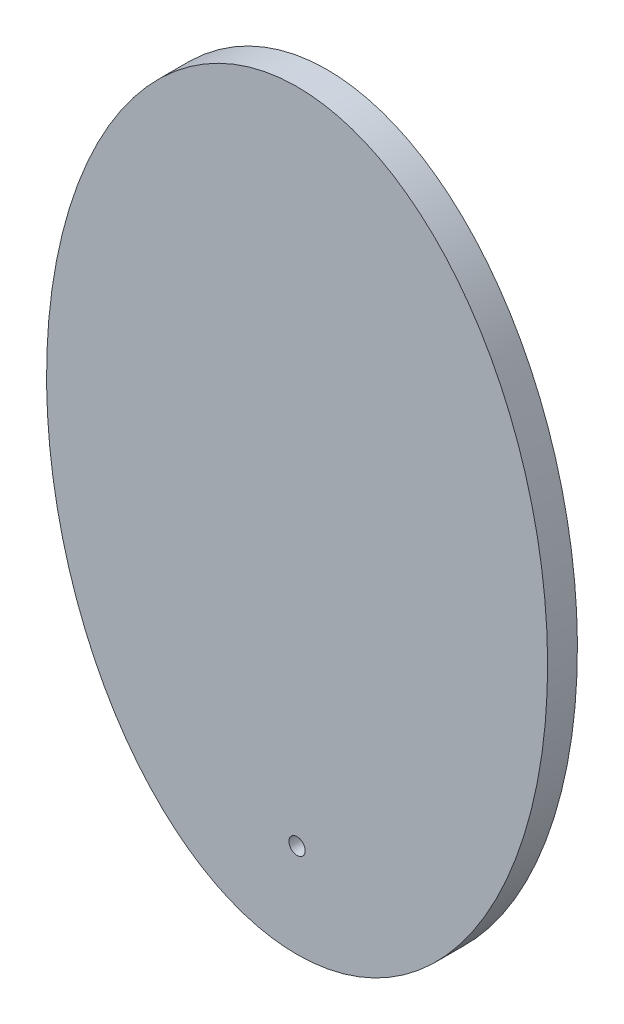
ISO-10303-21;
HEADER;
FILE_DESCRIPTION(('STEP AP214'),'2;1');
FILE_NAME('part.step','',(''),(''),'','','');
FILE_SCHEMA(('AUTOMOTIVE_DESIGN { 1 0 10303 214 1 1 1 1 }'));
ENDSEC;
DATA;
#1=APPLICATION_CONTEXT('core data for automotive mechanical design processes');
#2=APPLICATION_PROTOCOL_DEFINITION('international standard','automotive_design',2000,#1);
#3=PRODUCT_CONTEXT('',#1,'mechanical');
#4=PRODUCT('Part','Part','',(#3));
#5=PRODUCT_RELATED_PRODUCT_CATEGORY('part','',(#4));
#6=PRODUCT_DEFINITION_FORMATION('','',#4);
#7=PRODUCT_DEFINITION_CONTEXT('part definition',#1,'design');
#8=PRODUCT_DEFINITION('design','',#6,#7);
#9=PRODUCT_DEFINITION_SHAPE('','',#8);
#10=(LENGTH_UNIT() NAMED_UNIT(*) SI_UNIT(.MILLI.,.METRE.));
#11=(NAMED_UNIT(*) PLANE_ANGLE_UNIT() SI_UNIT($,.RADIAN.));
#12=(NAMED_UNIT(*) SI_UNIT($,.STERADIAN.) SOLID_ANGLE_UNIT());
#13=UNCERTAINTY_MEASURE_WITH_UNIT(LENGTH_MEASURE(1.E-05),#10,'distance_accuracy_value','');
#14=(GEOMETRIC_REPRESENTATION_CONTEXT(3) GLOBAL_UNCERTAINTY_ASSIGNED_CONTEXT((#13)) GLOBAL_UNIT_ASSIGNED_CONTEXT((#10,
#11,#12)) REPRESENTATION_CONTEXT('',''));
#15=CARTESIAN_POINT('',(0.,0.,0.));
#16=DIRECTION('',(0.,0.,1.));
#17=DIRECTION('',(1.,0.,0.));
#18=AXIS2_PLACEMENT_3D('',#15,#16,#17);
#19=CARTESIAN_POINT('',(0.,0.,-4.7625));
#20=DIRECTION('',(0.,0.,1.));
#21=DIRECTION('',(0.,-1.,0.));
#22=AXIS2_PLACEMENT_3D('',#19,#20,#21);
#23=ELLIPSE('',#22,60.,40.);
#24=DIRECTION('',(0.,0.,1.));
#25=VECTOR('',#24,1.);
#26=SURFACE_OF_LINEAR_EXTRUSION('',#23,#25);
#27=CARTESIAN_POINT('',(0.,-60.,-4.7625));
#28=VERTEX_POINT('',#27);
#29=EDGE_CURVE('E10',#28,#28,#23,.T.);
#30=ORIENTED_EDGE('',*,*,#29,.T.);
#31=EDGE_LOOP('',(#30));
#32=FACE_BOUND('',#31,.T.);
#33=CARTESIAN_POINT('',(0.,0.,0.));
#34=DIRECTION('',(0.,0.,1.));
#35=DIRECTION('',(0.,-1.,0.));
#36=AXIS2_PLACEMENT_3D('',#33,#34,#35);
#37=ELLIPSE('',#36,60.,40.);
#38=CARTESIAN_POINT('',(0.,-60.,0.));
#39=VERTEX_POINT('',#38);
#40=EDGE_CURVE('E40',#39,#39,#37,.T.);
#41=ORIENTED_EDGE('',*,*,#40,.F.);
#42=EDGE_LOOP('',(#41));
#43=FACE_BOUND('',#42,.T.);
#44=ADVANCED_FACE('F32',(#32,#43),#26,.T.);
#45=CARTESIAN_POINT('',(0.,0.,-4.7625));
#46=DIRECTION('',(0.,0.,1.));
#47=DIRECTION('',(1.,0.,0.));
#48=AXIS2_PLACEMENT_3D('',#45,#46,#47);
#49=PLANE('',#48);
#50=CARTESIAN_POINT('',(0.,-45.,-4.7625));
#51=DIRECTION('',(0.,0.,-1.));
#52=DIRECTION('',(0.,1.,0.));
#53=AXIS2_PLACEMENT_3D('',#50,#51,#52);
#54=CIRCLE('',#53,1.3);
#55=CARTESIAN_POINT('',(0.,-43.7,-4.7625));
#56=VERTEX_POINT('',#55);
#57=EDGE_CURVE('E98',#56,#56,#54,.T.);
#58=ORIENTED_EDGE('',*,*,#57,.F.);
#59=EDGE_LOOP('',(#58));
#60=FACE_BOUND('',#59,.T.);
#61=CARTESIAN_POINT('',(31.9550357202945,-30.,-4.7625));
#62=DIRECTION('',(0.,0.,-1.));
#63=DIRECTION('',(0.,1.,0.));
#64=AXIS2_PLACEMENT_3D('',#61,#62,#63);
#65=CIRCLE('',#64,2.25);
#66=CARTESIAN_POINT('',(31.9550357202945,-27.75,-4.7625));
#67=VERTEX_POINT('',#66);
#68=EDGE_CURVE('E80',#67,#67,#65,.T.);
#69=ORIENTED_EDGE('',*,*,#68,.F.);
#70=EDGE_LOOP('',(#69));
#71=FACE_BOUND('',#70,.T.);
#72=CARTESIAN_POINT('',(-31.9549994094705,-30.,-4.7625));
#73=DIRECTION('',(0.,0.,-1.));
#74=DIRECTION('',(0.,1.,0.));
#75=AXIS2_PLACEMENT_3D('',#72,#73,#74);
#76=CIRCLE('',#75,2.25);
#77=CARTESIAN_POINT('',(-31.9549994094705,-27.75,-4.7625));
#78=VERTEX_POINT('',#77);
#79=EDGE_CURVE('E87',#78,#78,#76,.T.);
#80=ORIENTED_EDGE('',*,*,#79,.F.);
#81=EDGE_LOOP('',(#80));
#82=FACE_BOUND('',#81,.T.);
#83=CARTESIAN_POINT('',(-26.879913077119,40.,-4.7625));
#84=DIRECTION('',(0.,0.,-1.));
#85=DIRECTION('',(0.,1.,0.));
#86=AXIS2_PLACEMENT_3D('',#83,#84,#85);
#87=CIRCLE('',#86,2.25);
#88=CARTESIAN_POINT('',(-26.879913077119,42.25,-4.7625));
#89=VERTEX_POINT('',#88);
#90=EDGE_CURVE('E93',#89,#89,#87,.T.);
#91=ORIENTED_EDGE('',*,*,#90,.F.);
#92=EDGE_LOOP('',(#91));
#93=FACE_BOUND('',#92,.T.);
#94=CARTESIAN_POINT('',(26.8808899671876,40.,-4.7625));
#95=DIRECTION('',(0.,0.,-1.));
#96=DIRECTION('',(0.,1.,0.));
#97=AXIS2_PLACEMENT_3D('',#94,#95,#96);
#98=CIRCLE('',#97,2.25);
#99=CARTESIAN_POINT('',(26.8808899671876,42.25,-4.7625));
#100=VERTEX_POINT('',#99);
#101=EDGE_CURVE('E74',#100,#100,#98,.T.);
#102=ORIENTED_EDGE('',*,*,#101,.F.);
#103=EDGE_LOOP('',(#102));
#104=FACE_BOUND('',#103,.T.);
#105=ORIENTED_EDGE('',*,*,#29,.F.);
#106=EDGE_LOOP('',(#105));
#107=FACE_BOUND('',#106,.T.);
#108=ADVANCED_FACE('F114',(#60,#71,#82,#93,#104,#107),#49,.F.);
#109=CARTESIAN_POINT('',(0.,0.,0.));
#110=DIRECTION('',(0.,0.,1.));
#111=DIRECTION('',(1.,0.,0.));
#112=AXIS2_PLACEMENT_3D('',#109,#110,#111);
#113=PLANE('',#112);
#114=CARTESIAN_POINT('',(0.,-45.,0.));
#115=DIRECTION('',(0.,0.,-1.));
#116=DIRECTION('',(0.,1.,0.));
#117=AXIS2_PLACEMENT_3D('',#114,#115,#116);
#118=CIRCLE('',#117,1.3);
#119=CARTESIAN_POINT('',(0.,-43.7,0.));
#120=VERTEX_POINT('',#119);
#121=EDGE_CURVE('E84',#120,#120,#118,.T.);
#122=ORIENTED_EDGE('',*,*,#121,.T.);
#123=EDGE_LOOP('',(#122));
#124=FACE_BOUND('',#123,.T.);
#125=ORIENTED_EDGE('',*,*,#40,.T.);
#126=EDGE_LOOP('',(#125));
#127=FACE_BOUND('',#126,.T.);
#128=ADVANCED_FACE('F104',(#124,#127),#113,.T.);
#129=CARTESIAN_POINT('',(31.9550357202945,-30.,-4.2625));
#130=DIRECTION('',(0.,0.,-1.));
#131=DIRECTION('',(0.,1.,0.));
#132=AXIS2_PLACEMENT_3D('',#129,#130,#131);
#133=PLANE('',#132);
#134=CARTESIAN_POINT('',(31.9550357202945,-30.,-4.2625));
#135=DIRECTION('',(0.,0.,-1.));
#136=DIRECTION('',(0.,1.,0.));
#137=AXIS2_PLACEMENT_3D('',#134,#135,#136);
#138=CIRCLE('',#137,2.25);
#139=CARTESIAN_POINT('',(31.9550357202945,-27.75,-4.2625));
#140=VERTEX_POINT('',#139);
#141=EDGE_CURVE('E83',#140,#140,#138,.T.);
#142=ORIENTED_EDGE('',*,*,#141,.T.);
#143=EDGE_LOOP('',(#142));
#144=FACE_BOUND('',#143,.T.);
#145=CARTESIAN_POINT('',(31.9550357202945,-30.,-4.2625));
#146=DIRECTION('',(0.,0.,-1.));
#147=DIRECTION('',(0.,1.,0.));
#148=AXIS2_PLACEMENT_3D('',#145,#146,#147);
#149=CIRCLE('',#148,1.65);
#150=CARTESIAN_POINT('',(31.9550357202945,-28.35,-4.2625));
#151=VERTEX_POINT('',#150);
#152=EDGE_CURVE('E50',#151,#151,#149,.F.);
#153=ORIENTED_EDGE('',*,*,#152,.T.);
#154=EDGE_LOOP('',(#153));
#155=FACE_BOUND('',#154,.T.);
#156=ADVANCED_FACE('F150',(#144,#155),#133,.T.);
#157=CARTESIAN_POINT('',(31.9550357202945,-30.,-4.2625));
#158=DIRECTION('',(0.,0.,-1.));
#159=DIRECTION('',(0.,1.,0.));
#160=AXIS2_PLACEMENT_3D('',#157,#158,#159);
#161=CYLINDRICAL_SURFACE('',#160,2.25);
#162=ORIENTED_EDGE('',*,*,#141,.F.);
#163=EDGE_LOOP('',(#162));
#164=FACE_BOUND('',#163,.T.);
#165=ORIENTED_EDGE('',*,*,#68,.T.);
#166=EDGE_LOOP('',(#165));
#167=FACE_BOUND('',#166,.T.);
#168=ADVANCED_FACE('F154',(#164,#167),#161,.F.);
#169=CARTESIAN_POINT('',(-31.9549994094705,-30.,-4.2625));
#170=DIRECTION('',(0.,0.,-1.));
#171=DIRECTION('',(0.,1.,0.));
#172=AXIS2_PLACEMENT_3D('',#169,#170,#171);
#173=PLANE('',#172);
#174=CARTESIAN_POINT('',(-31.9549994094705,-30.,-4.2625));
#175=DIRECTION('',(0.,0.,-1.));
#176=DIRECTION('',(0.,1.,0.));
#177=AXIS2_PLACEMENT_3D('',#174,#175,#176);
#178=CIRCLE('',#177,2.25);
#179=CARTESIAN_POINT('',(-31.9549994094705,-27.75,-4.2625));
#180=VERTEX_POINT('',#179);
#181=EDGE_CURVE('E90',#180,#180,#178,.T.);
#182=ORIENTED_EDGE('',*,*,#181,.T.);
#183=EDGE_LOOP('',(#182));
#184=FACE_BOUND('',#183,.T.);
#185=CARTESIAN_POINT('',(-31.9549994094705,-30.,-4.2625));
#186=DIRECTION('',(0.,0.,-1.));
#187=DIRECTION('',(0.,1.,0.));
#188=AXIS2_PLACEMENT_3D('',#185,#186,#187);
#189=CIRCLE('',#188,1.65);
#190=CARTESIAN_POINT('',(-31.9549994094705,-28.35,-4.2625));
#191=VERTEX_POINT('',#190);
#192=EDGE_CURVE('E53',#191,#191,#189,.F.);
#193=ORIENTED_EDGE('',*,*,#192,.T.);
#194=EDGE_LOOP('',(#193));
#195=FACE_BOUND('',#194,.T.);
#196=ADVANCED_FACE('F261',(#184,#195),#173,.T.);
#197=CARTESIAN_POINT('',(-31.9549994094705,-30.,-4.2625));
#198=DIRECTION('',(0.,0.,-1.));
#199=DIRECTION('',(0.,1.,0.));
#200=AXIS2_PLACEMENT_3D('',#197,#198,#199);
#201=CYLINDRICAL_SURFACE('',#200,2.25);
#202=ORIENTED_EDGE('',*,*,#181,.F.);
#203=EDGE_LOOP('',(#202));
#204=FACE_BOUND('',#203,.T.);
#205=ORIENTED_EDGE('',*,*,#79,.T.);
#206=EDGE_LOOP('',(#205));
#207=FACE_BOUND('',#206,.T.);
#208=ADVANCED_FACE('F270',(#204,#207),#201,.F.);
#209=CARTESIAN_POINT('',(-26.879913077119,40.,-4.2625));
#210=DIRECTION('',(0.,0.,-1.));
#211=DIRECTION('',(0.,1.,0.));
#212=AXIS2_PLACEMENT_3D('',#209,#210,#211);
#213=PLANE('',#212);
#214=CARTESIAN_POINT('',(-26.879913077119,40.,-4.2625));
#215=DIRECTION('',(0.,0.,-1.));
#216=DIRECTION('',(0.,1.,0.));
#217=AXIS2_PLACEMENT_3D('',#214,#215,#216);
#218=CIRCLE('',#217,2.25);
#219=CARTESIAN_POINT('',(-26.879913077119,42.25,-4.2625));
#220=VERTEX_POINT('',#219);
#221=EDGE_CURVE('E77',#220,#220,#218,.T.);
#222=ORIENTED_EDGE('',*,*,#221,.T.);
#223=EDGE_LOOP('',(#222));
#224=FACE_BOUND('',#223,.T.);
#225=CARTESIAN_POINT('',(-26.879913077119,40.,-4.2625));
#226=DIRECTION('',(0.,0.,-1.));
#227=DIRECTION('',(0.,1.,0.));
#228=AXIS2_PLACEMENT_3D('',#225,#226,#227);
#229=CIRCLE('',#228,1.65);
#230=CARTESIAN_POINT('',(-26.879913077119,41.65,-4.2625));
#231=VERTEX_POINT('',#230);
#232=EDGE_CURVE('E56',#231,#231,#229,.F.);
#233=ORIENTED_EDGE('',*,*,#232,.T.);
#234=EDGE_LOOP('',(#233));
#235=FACE_BOUND('',#234,.T.);
#236=ADVANCED_FACE('F279',(#224,#235),#213,.T.);
#237=CARTESIAN_POINT('',(-26.879913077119,40.,-4.2625));
#238=DIRECTION('',(0.,0.,-1.));
#239=DIRECTION('',(0.,1.,0.));
#240=AXIS2_PLACEMENT_3D('',#237,#238,#239);
#241=CYLINDRICAL_SURFACE('',#240,2.25);
#242=ORIENTED_EDGE('',*,*,#221,.F.);
#243=EDGE_LOOP('',(#242));
#244=FACE_BOUND('',#243,.T.);
#245=ORIENTED_EDGE('',*,*,#90,.T.);
#246=EDGE_LOOP('',(#245));
#247=FACE_BOUND('',#246,.T.);
#248=ADVANCED_FACE('F139',(#244,#247),#241,.F.);
#249=CARTESIAN_POINT('',(26.8808899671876,40.,-4.2625));
#250=DIRECTION('',(0.,0.,-1.));
#251=DIRECTION('',(0.,1.,0.));
#252=AXIS2_PLACEMENT_3D('',#249,#250,#251);
#253=PLANE('',#252);
#254=CARTESIAN_POINT('',(26.8808899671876,40.,-4.2625));
#255=DIRECTION('',(0.,0.,-1.));
#256=DIRECTION('',(0.,1.,0.));
#257=AXIS2_PLACEMENT_3D('',#254,#255,#256);
#258=CIRCLE('',#257,2.25);
#259=CARTESIAN_POINT('',(26.8808899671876,42.25,-4.2625));
#260=VERTEX_POINT('',#259);
#261=EDGE_CURVE('E54',#260,#260,#258,.T.);
#262=ORIENTED_EDGE('',*,*,#261,.T.);
#263=EDGE_LOOP('',(#262));
#264=FACE_BOUND('',#263,.T.);
#265=CARTESIAN_POINT('',(26.8808899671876,40.,-4.2625));
#266=DIRECTION('',(0.,0.,-1.));
#267=DIRECTION('',(0.,1.,0.));
#268=AXIS2_PLACEMENT_3D('',#265,#266,#267);
#269=CIRCLE('',#268,1.65);
#270=CARTESIAN_POINT('',(26.8808899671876,41.65,-4.2625));
#271=VERTEX_POINT('',#270);
#272=EDGE_CURVE('E36',#271,#271,#269,.F.);
#273=ORIENTED_EDGE('',*,*,#272,.T.);
#274=EDGE_LOOP('',(#273));
#275=FACE_BOUND('',#274,.T.);
#276=ADVANCED_FACE('F130',(#264,#275),#253,.T.);
#277=CARTESIAN_POINT('',(26.8808899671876,40.,-4.2625));
#278=DIRECTION('',(0.,0.,-1.));
#279=DIRECTION('',(0.,1.,0.));
#280=AXIS2_PLACEMENT_3D('',#277,#278,#279);
#281=CYLINDRICAL_SURFACE('',#280,2.25);
#282=ORIENTED_EDGE('',*,*,#261,.F.);
#283=EDGE_LOOP('',(#282));
#284=FACE_BOUND('',#283,.T.);
#285=ORIENTED_EDGE('',*,*,#101,.T.);
#286=EDGE_LOOP('',(#285));
#287=FACE_BOUND('',#286,.T.);
#288=ADVANCED_FACE('F127',(#284,#287),#281,.F.);
#289=CARTESIAN_POINT('',(31.9550357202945,-30.,-1.7625));
#290=DIRECTION('',(0.,0.,-1.));
#291=DIRECTION('',(0.,1.,0.));
#292=AXIS2_PLACEMENT_3D('',#289,#290,#291);
#293=PLANE('',#292);
#294=CARTESIAN_POINT('',(31.9550357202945,-30.,-1.7625));
#295=DIRECTION('',(0.,0.,-1.));
#296=DIRECTION('',(0.,1.,0.));
#297=AXIS2_PLACEMENT_3D('',#294,#295,#296);
#298=CIRCLE('',#297,1.65);
#299=CARTESIAN_POINT('',(31.9550357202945,-28.35,-1.7625));
#300=VERTEX_POINT('',#299);
#301=EDGE_CURVE('E61',#300,#300,#298,.T.);
#302=ORIENTED_EDGE('',*,*,#301,.T.);
#303=EDGE_LOOP('',(#302));
#304=FACE_BOUND('',#303,.T.);
#305=ADVANCED_FACE('F129',(#304),#293,.T.);
#306=CARTESIAN_POINT('',(31.9550357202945,-30.,-1.7625));
#307=DIRECTION('',(0.,0.,-1.));
#308=DIRECTION('',(0.,1.,0.));
#309=AXIS2_PLACEMENT_3D('',#306,#307,#308);
#310=CYLINDRICAL_SURFACE('',#309,1.65);
#311=ORIENTED_EDGE('',*,*,#301,.F.);
#312=EDGE_LOOP('',(#311));
#313=FACE_BOUND('',#312,.T.);
#314=ORIENTED_EDGE('',*,*,#152,.F.);
#315=EDGE_LOOP('',(#314));
#316=FACE_BOUND('',#315,.T.);
#317=ADVANCED_FACE('F137',(#313,#316),#310,.F.);
#318=CARTESIAN_POINT('',(-31.9549994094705,-30.,-1.7625));
#319=DIRECTION('',(0.,0.,-1.));
#320=DIRECTION('',(0.,1.,0.));
#321=AXIS2_PLACEMENT_3D('',#318,#319,#320);
#322=PLANE('',#321);
#323=CARTESIAN_POINT('',(-31.9549994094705,-30.,-1.7625));
#324=DIRECTION('',(0.,0.,-1.));
#325=DIRECTION('',(0.,1.,0.));
#326=AXIS2_PLACEMENT_3D('',#323,#324,#325);
#327=CIRCLE('',#326,1.65);
#328=CARTESIAN_POINT('',(-31.9549994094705,-28.35,-1.7625));
#329=VERTEX_POINT('',#328);
#330=EDGE_CURVE('E65',#329,#329,#327,.T.);
#331=ORIENTED_EDGE('',*,*,#330,.T.);
#332=EDGE_LOOP('',(#331));
#333=FACE_BOUND('',#332,.T.);
#334=ADVANCED_FACE('F167',(#333),#322,.T.);
#335=CARTESIAN_POINT('',(-31.9549994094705,-30.,-1.7625));
#336=DIRECTION('',(0.,0.,-1.));
#337=DIRECTION('',(0.,1.,0.));
#338=AXIS2_PLACEMENT_3D('',#335,#336,#337);
#339=CYLINDRICAL_SURFACE('',#338,1.65);
#340=ORIENTED_EDGE('',*,*,#330,.F.);
#341=EDGE_LOOP('',(#340));
#342=FACE_BOUND('',#341,.T.);
#343=ORIENTED_EDGE('',*,*,#192,.F.);
#344=EDGE_LOOP('',(#343));
#345=FACE_BOUND('',#344,.T.);
#346=ADVANCED_FACE('F170',(#342,#345),#339,.F.);
#347=CARTESIAN_POINT('',(-26.879913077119,40.,-1.7625));
#348=DIRECTION('',(0.,0.,-1.));
#349=DIRECTION('',(0.,1.,0.));
#350=AXIS2_PLACEMENT_3D('',#347,#348,#349);
#351=PLANE('',#350);
#352=CARTESIAN_POINT('',(-26.879913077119,40.,-1.7625));
#353=DIRECTION('',(0.,0.,-1.));
#354=DIRECTION('',(0.,1.,0.));
#355=AXIS2_PLACEMENT_3D('',#352,#353,#354);
#356=CIRCLE('',#355,1.65);
#357=CARTESIAN_POINT('',(-26.879913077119,41.65,-1.7625));
#358=VERTEX_POINT('',#357);
#359=EDGE_CURVE('E69',#358,#358,#356,.T.);
#360=ORIENTED_EDGE('',*,*,#359,.T.);
#361=EDGE_LOOP('',(#360));
#362=FACE_BOUND('',#361,.T.);
#363=ADVANCED_FACE('F173',(#362),#351,.T.);
#364=CARTESIAN_POINT('',(-26.879913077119,40.,-1.7625));
#365=DIRECTION('',(0.,0.,-1.));
#366=DIRECTION('',(0.,1.,0.));
#367=AXIS2_PLACEMENT_3D('',#364,#365,#366);
#368=CYLINDRICAL_SURFACE('',#367,1.65);
#369=ORIENTED_EDGE('',*,*,#359,.F.);
#370=EDGE_LOOP('',(#369));
#371=FACE_BOUND('',#370,.T.);
#372=ORIENTED_EDGE('',*,*,#232,.F.);
#373=EDGE_LOOP('',(#372));
#374=FACE_BOUND('',#373,.T.);
#375=ADVANCED_FACE('F164',(#371,#374),#368,.F.);
#376=CARTESIAN_POINT('',(26.8808899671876,40.,-1.7625));
#377=DIRECTION('',(0.,0.,-1.));
#378=DIRECTION('',(0.,1.,0.));
#379=AXIS2_PLACEMENT_3D('',#376,#377,#378);
#380=PLANE('',#379);
#381=CARTESIAN_POINT('',(26.8808899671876,40.,-1.7625));
#382=DIRECTION('',(0.,0.,-1.));
#383=DIRECTION('',(0.,1.,0.));
#384=AXIS2_PLACEMENT_3D('',#381,#382,#383);
#385=CIRCLE('',#384,1.65);
#386=CARTESIAN_POINT('',(26.8808899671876,41.65,-1.7625));
#387=VERTEX_POINT('',#386);
#388=EDGE_CURVE('E44',#387,#387,#385,.T.);
#389=ORIENTED_EDGE('',*,*,#388,.T.);
#390=EDGE_LOOP('',(#389));
#391=FACE_BOUND('',#390,.T.);
#392=ADVANCED_FACE('F160',(#391),#380,.T.);
#393=CARTESIAN_POINT('',(26.8808899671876,40.,-1.7625));
#394=DIRECTION('',(0.,0.,-1.));
#395=DIRECTION('',(0.,1.,0.));
#396=AXIS2_PLACEMENT_3D('',#393,#394,#395);
#397=CYLINDRICAL_SURFACE('',#396,1.65);
#398=ORIENTED_EDGE('',*,*,#388,.F.);
#399=EDGE_LOOP('',(#398));
#400=FACE_BOUND('',#399,.T.);
#401=ORIENTED_EDGE('',*,*,#272,.F.);
#402=EDGE_LOOP('',(#401));
#403=FACE_BOUND('',#402,.T.);
#404=ADVANCED_FACE('F110',(#400,#403),#397,.F.);
#405=CARTESIAN_POINT('',(0.,-45.,0.));
#406=DIRECTION('',(0.,0.,-1.));
#407=DIRECTION('',(0.,1.,0.));
#408=AXIS2_PLACEMENT_3D('',#405,#406,#407);
#409=CYLINDRICAL_SURFACE('',#408,1.3);
#410=ORIENTED_EDGE('',*,*,#121,.F.);
#411=EDGE_LOOP('',(#410));
#412=FACE_BOUND('',#411,.T.);
#413=ORIENTED_EDGE('',*,*,#57,.T.);
#414=EDGE_LOOP('',(#413));
#415=FACE_BOUND('',#414,.T.);
#416=ADVANCED_FACE('F107',(#412,#415),#409,.F.);
#417=CLOSED_SHELL('',(#44,#108,#128,#156,#168,#196,#208,#236,#248,#276,#288,#305,#317,#334,#346,
#363,#375,#392,#404,#416));
#418=MANIFOLD_SOLID_BREP('B2',#417);
#419=ADVANCED_BREP_SHAPE_REPRESENTATION('',(#18,#418),#14);
#420=SHAPE_DEFINITION_REPRESENTATION(#9,#419);
ENDSEC;
END-ISO-10303-21;
